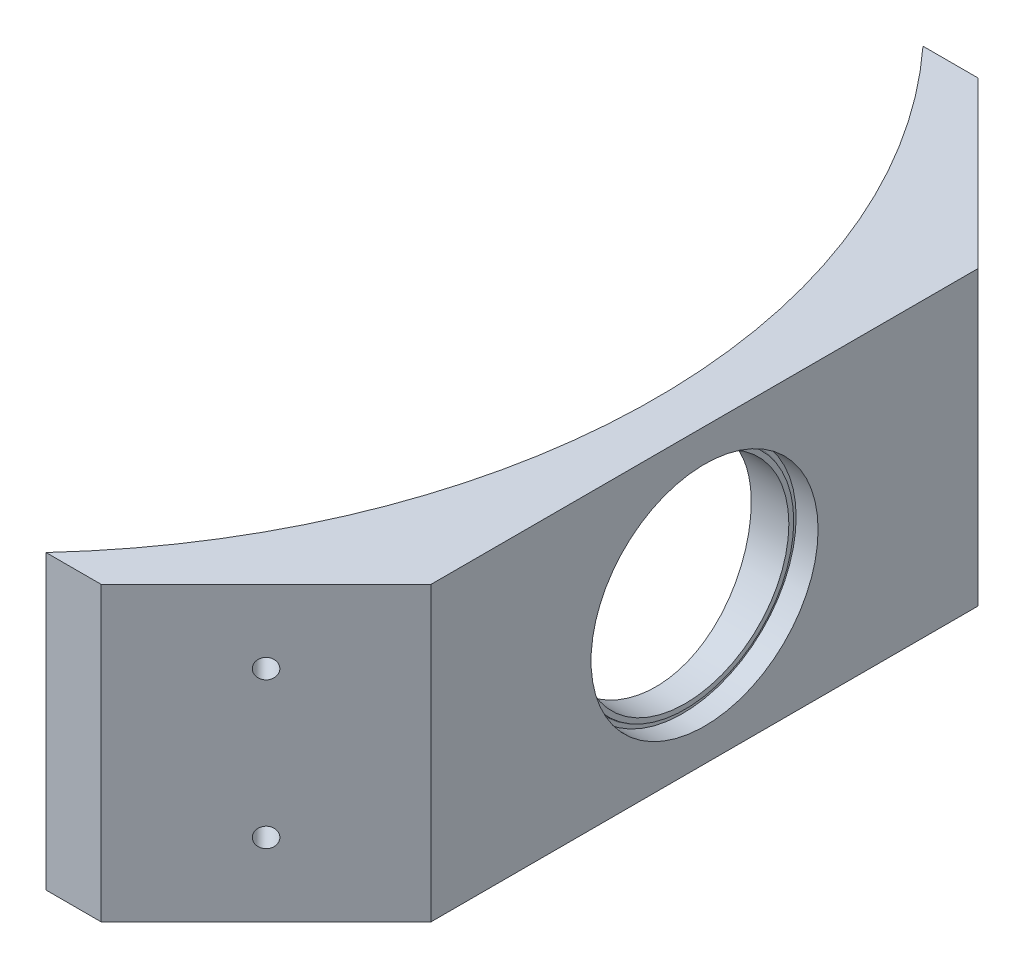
ISO-10303-21;
HEADER;
FILE_DESCRIPTION(('STEP AP214'),'2;1');
FILE_NAME('part.step','',(''),(''),'','','');
FILE_SCHEMA(('AUTOMOTIVE_DESIGN { 1 0 10303 214 1 1 1 1 }'));
ENDSEC;
DATA;
#1=APPLICATION_CONTEXT('core data for automotive mechanical design processes');
#2=APPLICATION_PROTOCOL_DEFINITION('international standard','automotive_design',2000,#1);
#3=PRODUCT_CONTEXT('',#1,'mechanical');
#4=PRODUCT('Part','Part','',(#3));
#5=PRODUCT_RELATED_PRODUCT_CATEGORY('part','',(#4));
#6=PRODUCT_DEFINITION_FORMATION('','',#4);
#7=PRODUCT_DEFINITION_CONTEXT('part definition',#1,'design');
#8=PRODUCT_DEFINITION('design','',#6,#7);
#9=PRODUCT_DEFINITION_SHAPE('','',#8);
#10=(LENGTH_UNIT() NAMED_UNIT(*) SI_UNIT(.MILLI.,.METRE.));
#11=(NAMED_UNIT(*) PLANE_ANGLE_UNIT() SI_UNIT($,.RADIAN.));
#12=(NAMED_UNIT(*) SI_UNIT($,.STERADIAN.) SOLID_ANGLE_UNIT());
#13=UNCERTAINTY_MEASURE_WITH_UNIT(LENGTH_MEASURE(1.E-05),#10,'distance_accuracy_value','');
#14=(GEOMETRIC_REPRESENTATION_CONTEXT(3) GLOBAL_UNCERTAINTY_ASSIGNED_CONTEXT((#13)) GLOBAL_UNIT_ASSIGNED_CONTEXT((#10,
#11,#12)) REPRESENTATION_CONTEXT('',''));
#15=CARTESIAN_POINT('',(0.,0.,0.));
#16=DIRECTION('',(0.,0.,1.));
#17=DIRECTION('',(1.,0.,0.));
#18=AXIS2_PLACEMENT_3D('',#15,#16,#17);
#19=CARTESIAN_POINT('',(-67.3699999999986,34.7500670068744,-4.81806655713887));
#20=DIRECTION('',(0.,1.,0.));
#21=DIRECTION('',(0.,0.,1.));
#22=AXIS2_PLACEMENT_3D('',#19,#20,#21);
#23=CYLINDRICAL_SURFACE('',#22,66.3699999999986);
#24=CARTESIAN_POINT('',(-9.5782322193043,57.2500670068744,-37.4537598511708));
#25=CARTESIAN_POINT('',(-9.57823080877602,57.3046931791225,-37.4537574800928));
#26=CARTESIAN_POINT('',(-9.5759381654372,57.3593606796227,-37.4496985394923));
#27=CARTESIAN_POINT('',(-9.56684343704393,57.4671640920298,-37.4335854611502));
#28=CARTESIAN_POINT('',(-9.56003576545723,57.520298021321,-37.4215214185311));
#29=CARTESIAN_POINT('',(-9.54216553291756,57.6234274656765,-37.3898148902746));
#30=CARTESIAN_POINT('',(-9.53110817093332,57.6734267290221,-37.3701816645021));
#31=CARTESIAN_POINT('',(-9.50512634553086,57.7689941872,-37.3239736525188));
#32=CARTESIAN_POINT('',(-9.49020262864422,57.814563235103,-37.2974002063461));
#33=CARTESIAN_POINT('',(-9.45672472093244,57.900788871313,-37.2376691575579));
#34=CARTESIAN_POINT('',(-9.43811861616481,57.9413599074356,-37.2044172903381));
#35=CARTESIAN_POINT('',(-9.39801634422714,58.0157927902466,-37.1325787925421));
#36=CARTESIAN_POINT('',(-9.3765196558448,58.049653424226,-37.093991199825));
#37=CARTESIAN_POINT('',(-9.33048232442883,58.1109673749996,-37.0111342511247));
#38=CARTESIAN_POINT('',(-9.30586172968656,58.1381563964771,-36.9667137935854));
#39=CARTESIAN_POINT('',(-9.25492880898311,58.1839658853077,-36.8745506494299));
#40=CARTESIAN_POINT('',(-9.22861616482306,58.2025847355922,-36.8268073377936));
#41=CARTESIAN_POINT('',(-9.17404529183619,58.231404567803,-36.7274864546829));
#42=CARTESIAN_POINT('',(-9.14575110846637,58.2412749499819,-36.6758325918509));
#43=CARTESIAN_POINT('',(-9.08890886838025,58.2512393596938,-36.5717251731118));
#44=CARTESIAN_POINT('',(-9.06036077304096,58.2513318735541,-36.5192714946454));
#45=CARTESIAN_POINT('',(-9.00311537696,58.2416462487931,-36.4137524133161));
#46=CARTESIAN_POINT('',(-8.97443024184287,58.2316368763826,-36.360701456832));
#47=CARTESIAN_POINT('',(-8.91840137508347,58.2016269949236,-36.2567530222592));
#48=CARTESIAN_POINT('',(-8.89105771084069,58.181625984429,-36.2058556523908));
#49=CARTESIAN_POINT('',(-8.83853402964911,58.1321232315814,-36.1078010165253));
#50=CARTESIAN_POINT('',(-8.81335082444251,58.1026358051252,-36.0606382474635));
#51=CARTESIAN_POINT('',(-8.76586140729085,58.0348509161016,-35.9714675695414));
#52=CARTESIAN_POINT('',(-8.74355481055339,57.9965546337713,-35.9294589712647));
#53=CARTESIAN_POINT('',(-8.70313423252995,57.9133677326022,-35.8531688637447));
#54=CARTESIAN_POINT('',(-8.68491755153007,57.8687001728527,-35.8186988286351));
#55=CARTESIAN_POINT('',(-8.65248481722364,57.7731964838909,-35.7572249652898));
#56=CARTESIAN_POINT('',(-8.6382676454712,57.7223620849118,-35.7302190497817));
#57=CARTESIAN_POINT('',(-8.61487470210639,57.6183897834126,-35.6857318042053));
#58=CARTESIAN_POINT('',(-8.60550352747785,57.565453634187,-35.6678815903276));
#59=CARTESIAN_POINT('',(-8.59121216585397,57.4568740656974,-35.6406433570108));
#60=CARTESIAN_POINT('',(-8.5862908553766,57.4012313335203,-35.6312532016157));
#61=CARTESIAN_POINT('',(-8.58117477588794,57.2910338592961,-35.6214910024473));
#62=CARTESIAN_POINT('',(-8.58081178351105,57.2365150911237,-35.6207979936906));
#63=CARTESIAN_POINT('',(-8.58439015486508,57.1281414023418,-35.6276265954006));
#64=CARTESIAN_POINT('',(-8.5883311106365,57.0742864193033,-35.6351474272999));
#65=CARTESIAN_POINT('',(-8.60031652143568,56.9693477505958,-35.6579979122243));
#66=CARTESIAN_POINT('',(-8.60831699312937,56.9182407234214,-35.6732438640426));
#67=CARTESIAN_POINT('',(-8.6281369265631,56.8195604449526,-35.7109601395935));
#68=CARTESIAN_POINT('',(-8.63995664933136,56.7719874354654,-35.7334309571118));
#69=CARTESIAN_POINT('',(-8.66732573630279,56.6806655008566,-35.7853688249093));
#70=CARTESIAN_POINT('',(-8.68294504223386,56.6370122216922,-35.8149669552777));
#71=CARTESIAN_POINT('',(-8.71732038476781,56.5556714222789,-35.8799632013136));
#72=CARTESIAN_POINT('',(-8.73607697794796,56.5179849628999,-35.9153623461));
#73=CARTESIAN_POINT('',(-8.7770207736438,56.4480311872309,-35.9924416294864));
#74=CARTESIAN_POINT('',(-8.79931529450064,56.4160413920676,-36.0343165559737));
#75=CARTESIAN_POINT('',(-8.84613466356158,56.360106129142,-36.12200490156));
#76=CARTESIAN_POINT('',(-8.87065998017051,56.3361623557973,-36.1678191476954));
#77=CARTESIAN_POINT('',(-8.92236671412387,56.2959898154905,-36.2641182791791));
#78=CARTESIAN_POINT('',(-8.94961622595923,56.280124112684,-36.3147182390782));
#79=CARTESIAN_POINT('',(-9.00511845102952,56.2579986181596,-36.41744805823));
#80=CARTESIAN_POINT('',(-9.03337133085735,56.2517404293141,-36.4695781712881));
#81=CARTESIAN_POINT('',(-9.09084416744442,56.2489456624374,-36.5752799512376));
#82=CARTESIAN_POINT('',(-9.1200705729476,56.2526576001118,-36.6288548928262));
#83=CARTESIAN_POINT('',(-9.17795548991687,56.2702851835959,-36.7346216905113));
#84=CARTESIAN_POINT('',(-9.20661397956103,56.2842012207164,-36.7868134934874));
#85=CARTESIAN_POINT('',(-9.2624627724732,56.321923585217,-36.8882141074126));
#86=CARTESIAN_POINT('',(-9.28965544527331,56.345713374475,-36.9374277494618));
#87=CARTESIAN_POINT('',(-9.34175885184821,56.402641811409,-37.0314647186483));
#88=CARTESIAN_POINT('',(-9.36666995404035,56.435778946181,-37.0762887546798));
#89=CARTESIAN_POINT('',(-9.41273808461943,56.5095677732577,-37.1589830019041));
#90=CARTESIAN_POINT('',(-9.43397729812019,56.5499963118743,-37.1970063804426));
#91=CARTESIAN_POINT('',(-9.4727444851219,56.6378617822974,-37.2662758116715));
#92=CARTESIAN_POINT('',(-9.49027231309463,56.6852989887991,-37.2975215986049));
#93=CARTESIAN_POINT('',(-9.52036891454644,56.7838937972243,-37.3510958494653));
#94=CARTESIAN_POINT('',(-9.53309976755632,56.8348436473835,-37.3737161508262));
#95=CARTESIAN_POINT('',(-9.55401874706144,56.9404387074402,-37.4108521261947));
#96=CARTESIAN_POINT('',(-9.56221376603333,56.9950781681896,-37.4253800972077));
#97=CARTESIAN_POINT('',(-9.57138999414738,57.0834650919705,-37.4416412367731));
#98=CARTESIAN_POINT('',(-9.57395185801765,57.1165648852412,-37.4461791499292));
#99=CARTESIAN_POINT('',(-9.57737338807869,57.1831269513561,-37.4522391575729));
#100=CARTESIAN_POINT('',(-9.57823308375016,57.2165892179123,-37.453761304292));
#101=CARTESIAN_POINT('',(-9.5782322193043,57.2500670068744,-37.4537598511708));
#102=B_SPLINE_CURVE_WITH_KNOTS('',3,(#24,#25,#26,#27,#28,#29,#30,#31,#32,#33,#34,#35,#36,#37,
#38,#39,#40,#41,#42,#43,#44,#45,#46,#47,#48,#49,#50,#51,#52,#53,#54,#55,#56,#57,#58,#59,#60,#61,
#62,#63,#64,#65,#66,#67,#68,#69,#70,#71,#72,#73,#74,#75,#76,#77,#78,#79,#80,#81,#82,#83,#84,#85,
#86,#87,#88,#89,#90,#91,#92,#93,#94,#95,#96,#97,#98,#99,#100,#101),.UNSPECIFIED.,.T.,.F.,(4,2,2,
2,2,2,2,2,2,2,2,2,2,2,2,2,2,2,2,2,2,2,2,2,2,2,2,2,2,2,2,2,2,2,2,2,2,2,4),(0.,0.163753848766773,
0.327710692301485,0.491467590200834,0.655192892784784,0.821416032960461,0.987669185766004,
1.15971390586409,1.33179107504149,1.51012340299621,1.68848333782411,1.87102068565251,
2.05356719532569,2.23583950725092,2.41808741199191,2.59505806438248,2.77197917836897,
2.94106408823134,3.1101062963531,3.27289089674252,3.43566006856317,3.59670219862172,
3.75775533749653,3.922033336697,4.08634051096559,4.25722887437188,4.42815320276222,
4.6062000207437,4.78427653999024,4.96683272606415,5.14939591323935,5.33165454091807,
5.51388368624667,5.69126907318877,5.86866141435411,6.03936434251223,6.2098071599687,
6.31016586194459,6.41052282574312),.UNSPECIFIED.);
#103=CARTESIAN_POINT('',(-9.5782322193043,57.2500670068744,-37.4537598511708));
#104=VERTEX_POINT('',#103);
#105=EDGE_CURVE('E179',#104,#104,#102,.T.);
#106=ORIENTED_EDGE('',*,*,#105,.T.);
#107=EDGE_LOOP('',(#106));
#108=FACE_BOUND('',#107,.T.);
#109=CARTESIAN_POINT('',(-8.65047059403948,57.2500670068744,26.1172492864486));
#110=CARTESIAN_POINT('',(-8.65047187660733,57.3044044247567,26.1172518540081));
#111=CARTESIAN_POINT('',(-8.65264034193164,57.3587832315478,26.1213688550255));
#112=CARTESIAN_POINT('',(-8.66124722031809,57.4660081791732,26.1376975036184));
#113=CARTESIAN_POINT('',(-8.66769095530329,57.5188523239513,26.1499192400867));
#114=CARTESIAN_POINT('',(-8.68462134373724,57.6214009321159,26.1819908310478));
#115=CARTESIAN_POINT('',(-8.69510208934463,57.6711098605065,26.2018295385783));
#116=CARTESIAN_POINT('',(-8.71976854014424,57.7661404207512,26.248441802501));
#117=CARTESIAN_POINT('',(-8.73395363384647,57.811462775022,26.2752142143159));
#118=CARTESIAN_POINT('',(-8.76592114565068,57.8974727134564,26.3354247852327));
#119=CARTESIAN_POINT('',(-8.78376935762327,57.9380504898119,26.3689846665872));
#120=CARTESIAN_POINT('',(-8.82236866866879,58.0125663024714,26.441387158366));
#121=CARTESIAN_POINT('',(-8.84312038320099,58.0465029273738,26.4802308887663));
#122=CARTESIAN_POINT('',(-8.88790028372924,58.1082854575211,26.5638271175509));
#123=CARTESIAN_POINT('',(-8.91202968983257,58.1358144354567,26.6087596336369));
#124=CARTESIAN_POINT('',(-8.96219048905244,58.1822798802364,26.701887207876));
#125=CARTESIAN_POINT('',(-8.98822227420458,58.2012145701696,26.7500829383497));
#126=CARTESIAN_POINT('',(-9.04252446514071,58.230643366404,26.8503066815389));
#127=CARTESIAN_POINT('',(-9.0708422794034,58.2407919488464,26.9024106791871));
#128=CARTESIAN_POINT('',(-9.12803492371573,58.2511795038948,27.0073002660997));
#129=CARTESIAN_POINT('',(-9.15690982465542,58.2514172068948,27.0600859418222));
#130=CARTESIAN_POINT('',(-9.2149233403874,58.2418695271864,27.1657989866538));
#131=CARTESIAN_POINT('',(-9.24405792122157,58.2319112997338,27.218713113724));
#132=CARTESIAN_POINT('',(-9.30123072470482,58.2018972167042,27.3222264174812));
#133=CARTESIAN_POINT('',(-9.32926895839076,58.1818414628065,27.3728256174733));
#134=CARTESIAN_POINT('',(-9.38310901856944,58.1323228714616,27.4697084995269));
#135=CARTESIAN_POINT('',(-9.4089302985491,58.1029554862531,27.5160300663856));
#136=CARTESIAN_POINT('',(-9.45779664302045,58.0354617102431,27.6034712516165));
#137=CARTESIAN_POINT('',(-9.48084215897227,57.9973367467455,27.6445917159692));
#138=CARTESIAN_POINT('',(-9.52267631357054,57.914659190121,27.7190785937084));
#139=CARTESIAN_POINT('',(-9.54157557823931,57.8703450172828,27.7526473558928));
#140=CARTESIAN_POINT('',(-9.5753249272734,57.7756631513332,27.8124960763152));
#141=CARTESIAN_POINT('',(-9.5901759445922,57.7252968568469,27.838777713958));
#142=CARTESIAN_POINT('',(-9.61478827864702,57.6219920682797,27.8822854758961));
#143=CARTESIAN_POINT('',(-9.62472051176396,57.569222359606,27.8998158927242));
#144=CARTESIAN_POINT('',(-9.63994074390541,57.4609934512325,27.926664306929));
#145=CARTESIAN_POINT('',(-9.64522960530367,57.4055347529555,27.9359838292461));
#146=CARTESIAN_POINT('',(-9.6508808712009,57.2951716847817,27.9459414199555));
#147=CARTESIAN_POINT('',(-9.65137709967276,57.240295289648,27.9468153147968));
#148=CARTESIAN_POINT('',(-9.64777428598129,57.1311682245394,27.940467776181));
#149=CARTESIAN_POINT('',(-9.643675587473,57.0769175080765,27.9332469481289));
#150=CARTESIAN_POINT('',(-9.63108346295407,56.9710136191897,27.9110424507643));
#151=CARTESIAN_POINT('',(-9.62262475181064,56.9193434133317,27.8961201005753));
#152=CARTESIAN_POINT('',(-9.60162993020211,56.8195577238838,27.8590320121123));
#153=CARTESIAN_POINT('',(-9.58909364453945,56.771442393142,27.8368659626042));
#154=CARTESIAN_POINT('',(-9.56015782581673,56.6793598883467,27.785613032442));
#155=CARTESIAN_POINT('',(-9.54370546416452,56.6354621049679,27.7564314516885));
#156=CARTESIAN_POINT('',(-9.50757396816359,56.553701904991,27.6922073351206));
#157=CARTESIAN_POINT('',(-9.48789440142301,56.5158402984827,27.6571640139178));
#158=CARTESIAN_POINT('',(-9.44525419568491,56.4459555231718,27.581048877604));
#159=CARTESIAN_POINT('',(-9.42221067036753,56.4141500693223,27.5398236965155));
#160=CARTESIAN_POINT('',(-9.37402165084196,56.3585912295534,27.4533735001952));
#161=CARTESIAN_POINT('',(-9.3488757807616,56.3348392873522,27.4081477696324));
#162=CARTESIAN_POINT('',(-9.29623294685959,56.2951549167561,27.3131881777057));
#163=CARTESIAN_POINT('',(-9.26868352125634,56.2795423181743,27.2633496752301));
#164=CARTESIAN_POINT('',(-9.21285736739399,56.2578021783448,27.1620367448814));
#165=CARTESIAN_POINT('',(-9.18458051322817,56.2516762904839,27.1105620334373));
#166=CARTESIAN_POINT('',(-9.12725243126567,56.2489755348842,27.0058696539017));
#167=CARTESIAN_POINT('',(-9.09820212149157,56.2526780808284,26.9526441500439));
#168=CARTESIAN_POINT('',(-9.04094192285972,56.270128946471,26.8473953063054));
#169=CARTESIAN_POINT('',(-9.0127321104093,56.2838781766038,26.7953720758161));
#170=CARTESIAN_POINT('',(-8.95774504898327,56.3212449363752,26.6936572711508));
#171=CARTESIAN_POINT('',(-8.93097928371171,56.344931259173,26.6439846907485));
#172=CARTESIAN_POINT('',(-8.87988043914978,56.4016307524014,26.5488862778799));
#173=CARTESIAN_POINT('',(-8.8555470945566,56.4346429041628,26.5034599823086));
#174=CARTESIAN_POINT('',(-8.81053873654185,56.5084022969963,26.4192289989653));
#175=CARTESIAN_POINT('',(-8.78979826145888,56.548974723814,26.3803064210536));
#176=CARTESIAN_POINT('',(-8.75203667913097,56.6372418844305,26.3092991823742));
#177=CARTESIAN_POINT('',(-8.73501565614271,56.6849367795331,26.2772146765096));
#178=CARTESIAN_POINT('',(-8.70589664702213,56.784015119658,26.2222428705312));
#179=CARTESIAN_POINT('',(-8.69362718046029,56.8351709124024,26.1990356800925));
#180=CARTESIAN_POINT('',(-8.67350586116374,56.941252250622,26.1609415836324));
#181=CARTESIAN_POINT('',(-8.66564693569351,56.996171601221,26.1460413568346));
#182=CARTESIAN_POINT('',(-8.6569223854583,57.0846273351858,26.1294932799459));
#183=CARTESIAN_POINT('',(-8.65450652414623,57.117495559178,26.1249090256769));
#184=CARTESIAN_POINT('',(-8.65128025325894,57.1835930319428,26.1187862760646));
#185=CARTESIAN_POINT('',(-8.65046980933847,57.2168222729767,26.1172477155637));
#186=CARTESIAN_POINT('',(-8.65047059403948,57.2500670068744,26.1172492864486));
#187=B_SPLINE_CURVE_WITH_KNOTS('',3,(#109,#110,#111,#112,#113,#114,#115,#116,#117,#118,#119,
#120,#121,#122,#123,#124,#125,#126,#127,#128,#129,#130,#131,#132,#133,#134,#135,#136,#137,#138,
#139,#140,#141,#142,#143,#144,#145,#146,#147,#148,#149,#150,#151,#152,#153,#154,#155,#156,#157,
#158,#159,#160,#161,#162,#163,#164,#165,#166,#167,#168,#169,#170,#171,#172,#173,#174,#175,#176,
#177,#178,#179,#180,#181,#182,#183,#184,#185,#186),.UNSPECIFIED.,.T.,.F.,(4,2,2,2,2,2,2,2,2,2,2,
2,2,2,2,2,2,2,2,2,2,2,2,2,2,2,2,2,2,2,2,2,2,2,2,2,2,2,4),(0.,0.162887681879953,
0.325978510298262,0.488831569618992,0.651657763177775,0.817714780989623,0.983807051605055,
1.15689845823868,1.33002563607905,1.50968676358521,1.6893709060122,1.8721523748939,
2.05493200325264,2.23589546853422,2.41682946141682,2.59210258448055,2.7673352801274,
2.93595542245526,3.10454424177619,3.26841149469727,3.43226649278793,3.59483656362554,
3.75741362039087,3.92232238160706,4.08725325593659,4.25730380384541,4.42738481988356,
4.60372314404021,4.78009219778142,4.96149193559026,5.14290811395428,5.32560149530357,
5.5082749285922,5.68715593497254,5.86604099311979,6.03768039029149,6.20904375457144,
6.30870387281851,6.40836185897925),.UNSPECIFIED.);
#188=CARTESIAN_POINT('',(-8.65047059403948,57.2500670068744,26.1172492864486));
#189=VERTEX_POINT('',#188);
#190=EDGE_CURVE('E168',#189,#189,#187,.T.);
#191=ORIENTED_EDGE('',*,*,#190,.T.);
#192=EDGE_LOOP('',(#191));
#193=FACE_BOUND('',#192,.T.);
#194=CARTESIAN_POINT('',(-1.86004350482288,49.7500670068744,-15.4680665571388));
#195=CARTESIAN_POINT('',(-1.86004543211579,49.4529302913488,-15.4680709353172));
#196=CARTESIAN_POINT('',(-1.85801794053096,49.1558535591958,-15.4556273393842));
#197=CARTESIAN_POINT('',(-1.84997101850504,48.5637419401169,-15.4059547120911));
#198=CARTESIAN_POINT('',(-1.84395077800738,48.2687074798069,-15.3687206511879));
#199=CARTESIAN_POINT('',(-1.82808438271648,47.6826510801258,-15.269702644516));
#200=CARTESIAN_POINT('',(-1.81823507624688,47.3916326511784,-15.20789847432));
#201=CARTESIAN_POINT('',(-1.79499747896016,46.8159083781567,-15.060211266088));
#202=CARTESIAN_POINT('',(-1.78160910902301,46.5312026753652,-14.9743276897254));
#203=CARTESIAN_POINT('',(-1.75169239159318,45.9703506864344,-14.7792075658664));
#204=CARTESIAN_POINT('',(-1.73516668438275,45.6941974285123,-14.6699906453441));
#205=CARTESIAN_POINT('',(-1.69944015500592,45.1521123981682,-14.4289615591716));
#206=CARTESIAN_POINT('',(-1.68023930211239,44.8861807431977,-14.2971491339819));
#207=CARTESIAN_POINT('',(-1.63970936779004,44.3664027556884,-14.0118977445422));
#208=CARTESIAN_POINT('',(-1.61838059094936,44.112554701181,-13.8584618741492));
#209=CARTESIAN_POINT('',(-1.57419114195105,43.6186250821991,-13.5310291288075));
#210=CARTESIAN_POINT('',(-1.55133045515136,43.3785436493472,-13.357032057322));
#211=CARTESIAN_POINT('',(-1.50452322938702,42.9118668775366,-12.9881767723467));
#212=CARTESIAN_POINT('',(-1.48056933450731,42.685398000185,-12.7931594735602));
#213=CARTESIAN_POINT('',(-1.43242601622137,42.2496560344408,-12.384802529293));
#214=CARTESIAN_POINT('',(-1.40823659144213,42.0403830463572,-12.1714627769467));
#215=CARTESIAN_POINT('',(-1.36029870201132,41.6404622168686,-11.7279134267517));
#216=CARTESIAN_POINT('',(-1.33655026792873,41.4498156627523,-11.4977026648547));
#217=CARTESIAN_POINT('',(-1.29016125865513,41.0884967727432,-11.0220094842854));
#218=CARTESIAN_POINT('',(-1.26752065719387,40.9178239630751,-10.7765274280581));
#219=CARTESIAN_POINT('',(-1.2238595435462,40.5967647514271,-10.2705724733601));
#220=CARTESIAN_POINT('',(-1.2028487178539,40.4464961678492,-10.0100239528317));
#221=CARTESIAN_POINT('',(-1.1631833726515,40.1684642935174,-9.47700860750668));
#222=CARTESIAN_POINT('',(-1.14452886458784,40.0407011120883,-9.20454172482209));
#223=CARTESIAN_POINT('',(-1.11010802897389,39.8086355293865,-8.64963024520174));
#224=CARTESIAN_POINT('',(-1.09434156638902,39.7043320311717,-8.36718611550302));
#225=CARTESIAN_POINT('',(-1.06614656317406,39.5199698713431,-7.79433068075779));
#226=CARTESIAN_POINT('',(-1.05371799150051,39.4399109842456,-7.50391944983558));
#227=CARTESIAN_POINT('',(-1.0326460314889,39.3052347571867,-6.91974627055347));
#228=CARTESIAN_POINT('',(-1.02397112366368,39.2504053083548,-6.62603435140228));
#229=CARTESIAN_POINT('',(-1.01049830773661,39.1656056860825,-6.03495520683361));
#230=CARTESIAN_POINT('',(-1.00570037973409,39.1356353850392,-5.73758800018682));
#231=CARTESIAN_POINT('',(-1.00011790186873,39.1007878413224,-5.14136591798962));
#232=CARTESIAN_POINT('',(-0.999333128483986,39.0959092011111,-4.84251112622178));
#233=CARTESIAN_POINT('',(-1.00179869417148,39.1112793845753,-4.24546599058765));
#234=CARTESIAN_POINT('',(-1.00504901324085,39.1315280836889,-3.9472756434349));
#235=CARTESIAN_POINT('',(-1.01544416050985,39.1966931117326,-3.35645203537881));
#236=CARTESIAN_POINT('',(-1.02255288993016,39.2413808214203,-3.06379288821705));
#237=CARTESIAN_POINT('',(-1.04044267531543,39.3549280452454,-2.48331904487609));
#238=CARTESIAN_POINT('',(-1.05122370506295,39.4237873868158,-2.19550431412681));
#239=CARTESIAN_POINT('',(-1.0761592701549,39.5851633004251,-1.62673115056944));
#240=CARTESIAN_POINT('',(-1.09031387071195,39.67768032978,-1.34577285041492));
#241=CARTESIAN_POINT('',(-1.12160541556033,39.8856892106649,-0.792665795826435));
#242=CARTESIAN_POINT('',(-1.13874237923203,40.0011812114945,-0.520517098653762));
#243=CARTESIAN_POINT('',(-1.17560573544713,40.2548451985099,0.0142429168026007));
#244=CARTESIAN_POINT('',(-1.19534286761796,40.3931118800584,0.276808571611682));
#245=CARTESIAN_POINT('',(-1.23680396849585,40.6909854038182,0.789375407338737));
#246=CARTESIAN_POINT('',(-1.25852794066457,40.8505922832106,1.03937656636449));
#247=CARTESIAN_POINT('',(-1.30336539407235,41.1900376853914,1.52513450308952));
#248=CARTESIAN_POINT('',(-1.32647896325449,41.3698774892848,1.76089037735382));
#249=CARTESIAN_POINT('',(-1.3734580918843,41.7485404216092,2.2165497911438));
#250=CARTESIAN_POINT('',(-1.39732365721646,41.9473636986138,2.43645320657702));
#251=CARTESIAN_POINT('',(-1.44541863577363,42.3649793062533,2.86130183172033));
#252=CARTESIAN_POINT('',(-1.46964911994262,42.5839712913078,3.06605071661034));
#253=CARTESIAN_POINT('',(-1.5175218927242,43.0384703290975,3.45639450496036));
#254=CARTESIAN_POINT('',(-1.54116417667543,43.2739775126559,3.64198925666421));
#255=CARTESIAN_POINT('',(-1.58718911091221,43.7598839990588,3.99272155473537));
#256=CARTESIAN_POINT('',(-1.60957174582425,44.0102834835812,4.15785885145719));
#257=CARTESIAN_POINT('',(-1.65243664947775,44.5242371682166,4.46649333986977));
#258=CARTESIAN_POINT('',(-1.67291892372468,44.7877913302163,4.60999059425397));
#259=CARTESIAN_POINT('',(-1.71141146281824,45.3264841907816,4.87443225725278));
#260=CARTESIAN_POINT('',(-1.72941924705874,45.6016341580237,4.9953540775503));
#261=CARTESIAN_POINT('',(-1.7624134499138,46.1613285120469,5.21356709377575));
#262=CARTESIAN_POINT('',(-1.77739986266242,46.445872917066,5.3108582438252));
#263=CARTESIAN_POINT('',(-1.80390940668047,47.0223000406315,5.48106400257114));
#264=CARTESIAN_POINT('',(-1.81543276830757,47.3141822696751,5.55398023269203));
#265=CARTESIAN_POINT('',(-1.83467570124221,47.9031884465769,5.67487978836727));
#266=CARTESIAN_POINT('',(-1.84239531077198,48.2003123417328,5.72286336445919));
#267=CARTESIAN_POINT('',(-1.85373746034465,48.7943178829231,5.79313017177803));
#268=CARTESIAN_POINT('',(-1.85740446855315,49.0911657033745,5.81569239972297));
#269=CARTESIAN_POINT('',(-1.8606863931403,49.6857295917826,5.83589220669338));
#270=CARTESIAN_POINT('',(-1.86030133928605,49.9834456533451,5.83352996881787));
#271=CARTESIAN_POINT('',(-1.8554905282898,50.5775920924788,5.80389992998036));
#272=CARTESIAN_POINT('',(-1.8510649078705,50.8740225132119,5.77663297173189));
#273=CARTESIAN_POINT('',(-1.83830269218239,51.4634786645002,5.69740557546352));
#274=CARTESIAN_POINT('',(-1.82996610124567,51.7565043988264,5.64544516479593));
#275=CARTESIAN_POINT('',(-1.80968437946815,52.3353664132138,5.51760334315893));
#276=CARTESIAN_POINT('',(-1.79776056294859,52.6212346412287,5.44186311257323));
#277=CARTESIAN_POINT('',(-1.77062918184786,53.1855416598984,5.26693589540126));
#278=CARTESIAN_POINT('',(-1.75542163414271,53.4639804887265,5.16774902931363));
#279=CARTESIAN_POINT('',(-1.72215414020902,54.011516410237,4.94665169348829));
#280=CARTESIAN_POINT('',(-1.70409410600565,54.2806132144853,4.8247405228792));
#281=CARTESIAN_POINT('',(-1.66562989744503,54.8076288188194,4.55906812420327));
#282=CARTESIAN_POINT('',(-1.64522564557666,55.0655472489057,4.41530617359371));
#283=CARTESIAN_POINT('',(-1.60246037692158,55.5706111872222,4.10562452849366));
#284=CARTESIAN_POINT('',(-1.58008410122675,55.8176455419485,3.93952564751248));
#285=CARTESIAN_POINT('',(-1.53415671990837,56.2968802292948,3.58729904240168));
#286=CARTESIAN_POINT('',(-1.5106056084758,56.529080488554,3.40117121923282));
#287=CARTESIAN_POINT('',(-1.46298561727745,56.9770836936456,3.01016023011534));
#288=CARTESIAN_POINT('',(-1.43891670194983,57.1928855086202,2.80527577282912));
#289=CARTESIAN_POINT('',(-1.39093312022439,57.606598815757,2.37816870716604));
#290=CARTESIAN_POINT('',(-1.36701845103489,57.8045106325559,2.15594641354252));
#291=CARTESIAN_POINT('',(-1.31978016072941,58.1829033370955,1.69345375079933));
#292=CARTESIAN_POINT('',(-1.29646444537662,58.3631980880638,1.45303023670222));
#293=CARTESIAN_POINT('',(-1.25132556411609,58.7028911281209,0.957712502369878));
#294=CARTESIAN_POINT('',(-1.22950240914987,58.8622892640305,0.70281817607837));
#295=CARTESIAN_POINT('',(-1.18796714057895,59.1590343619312,0.180342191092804));
#296=CARTESIAN_POINT('',(-1.1682549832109,59.2963817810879,-0.0872392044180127));
#297=CARTESIAN_POINT('',(-1.13150117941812,59.548017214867,-0.633210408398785));
#298=CARTESIAN_POINT('',(-1.11445951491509,59.662305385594,-0.911600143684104));
#299=CARTESIAN_POINT('',(-1.08359639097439,59.8665416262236,-1.47603952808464));
#300=CARTESIAN_POINT('',(-1.0697619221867,59.9565882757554,-1.76205279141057));
#301=CARTESIAN_POINT('',(-1.04561617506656,60.1122777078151,-2.34079331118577));
#302=CARTESIAN_POINT('',(-1.03530489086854,60.1779205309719,-2.63352055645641));
#303=CARTESIAN_POINT('',(-1.0185001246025,60.284292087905,-3.2235570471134));
#304=CARTESIAN_POINT('',(-1.01200639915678,60.3250224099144,-3.52086599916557));
#305=CARTESIAN_POINT('',(-1.00302156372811,60.3812569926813,-4.11791943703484));
#306=CARTESIAN_POINT('',(-1.0005304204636,60.3967614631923,-4.41766390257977));
#307=CARTESIAN_POINT('',(-0.999626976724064,60.4023916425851,-5.01402602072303));
#308=CARTESIAN_POINT('',(-1.00116916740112,60.3928005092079,-5.31064096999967));
#309=CARTESIAN_POINT('',(-1.00819284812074,60.3489120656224,-5.90198833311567));
#310=CARTESIAN_POINT('',(-1.0136743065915,60.3146149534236,-6.19672076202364));
#311=CARTESIAN_POINT('',(-1.02842307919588,60.2215775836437,-6.78220187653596));
#312=CARTESIAN_POINT('',(-1.03769036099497,60.1628375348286,-7.07295059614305));
#313=CARTESIAN_POINT('',(-1.0597522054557,60.0213590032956,-7.64841186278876));
#314=CARTESIAN_POINT('',(-1.0725467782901,59.9386204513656,-7.93312439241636));
#315=CARTESIAN_POINT('',(-1.10129356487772,59.7498539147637,-8.49424674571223));
#316=CARTESIAN_POINT('',(-1.11724270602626,59.643848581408,-8.77066434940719));
#317=CARTESIAN_POINT('',(-1.15186578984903,59.4092774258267,-9.31357530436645));
#318=CARTESIAN_POINT('',(-1.17053972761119,59.2807116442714,-9.58006867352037));
#319=CARTESIAN_POINT('',(-1.21009489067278,59.0019675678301,-10.101262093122));
#320=CARTESIAN_POINT('',(-1.23097569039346,58.8517934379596,-10.3559644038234));
#321=CARTESIAN_POINT('',(-1.2743849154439,58.5307972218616,-10.8520200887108));
#322=CARTESIAN_POINT('',(-1.29691407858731,58.3599658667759,-11.093367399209));
#323=CARTESIAN_POINT('',(-1.34324066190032,57.9969626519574,-11.5634603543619));
#324=CARTESIAN_POINT('',(-1.36704903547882,57.8045828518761,-11.7920443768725));
#325=CARTESIAN_POINT('',(-1.41503447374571,57.4014139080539,-12.2321350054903));
#326=CARTESIAN_POINT('',(-1.43921138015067,57.1906324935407,-12.443648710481));
#327=CARTESIAN_POINT('',(-1.48727769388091,56.7519411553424,-12.8483439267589));
#328=CARTESIAN_POINT('',(-1.5111669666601,56.5240235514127,-13.0415171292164));
#329=CARTESIAN_POINT('',(-1.55797433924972,56.0527089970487,-13.4080799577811));
#330=CARTESIAN_POINT('',(-1.58089244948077,55.8093122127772,-13.5814697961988));
#331=CARTESIAN_POINT('',(-1.62525347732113,55.3070677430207,-13.9083137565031));
#332=CARTESIAN_POINT('',(-1.64668577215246,55.0481294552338,-14.061630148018));
#333=CARTESIAN_POINT('',(-1.68728921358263,54.5180767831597,-14.3458691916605));
#334=CARTESIAN_POINT('',(-1.70646039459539,54.2469625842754,-14.4767921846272));
#335=CARTESIAN_POINT('',(-1.74196686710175,53.6947040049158,-14.715171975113));
#336=CARTESIAN_POINT('',(-1.75830466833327,53.4135687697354,-14.822649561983));
#337=CARTESIAN_POINT('',(-1.78768242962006,52.8431487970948,-15.0134483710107));
#338=CARTESIAN_POINT('',(-1.80072311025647,52.5538658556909,-15.0967748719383));
#339=CARTESIAN_POINT('',(-1.82764101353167,51.8510786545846,-15.267298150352));
#340=CARTESIAN_POINT('',(-1.83973393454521,51.4345348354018,-15.3424987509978));
#341=CARTESIAN_POINT('',(-1.8559337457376,50.595309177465,-15.4428794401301));
#342=CARTESIAN_POINT('',(-1.86004076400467,50.1726274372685,-15.4680603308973));
#343=CARTESIAN_POINT('',(-1.86004350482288,49.7500670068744,-15.4680665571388));
#344=B_SPLINE_CURVE_WITH_KNOTS('',3,(#194,#195,#196,#197,#198,#199,#200,#201,#202,#203,#204,
#205,#206,#207,#208,#209,#210,#211,#212,#213,#214,#215,#216,#217,#218,#219,#220,#221,#222,#223,
#224,#225,#226,#227,#228,#229,#230,#231,#232,#233,#234,#235,#236,#237,#238,#239,#240,#241,#242,
#243,#244,#245,#246,#247,#248,#249,#250,#251,#252,#253,#254,#255,#256,#257,#258,#259,#260,#261,
#262,#263,#264,#265,#266,#267,#268,#269,#270,#271,#272,#273,#274,#275,#276,#277,#278,#279,#280,
#281,#282,#283,#284,#285,#286,#287,#288,#289,#290,#291,#292,#293,#294,#295,#296,#297,#298,#299,
#300,#301,#302,#303,#304,#305,#306,#307,#308,#309,#310,#311,#312,#313,#314,#315,#316,#317,#318,
#319,#320,#321,#322,#323,#324,#325,#326,#327,#328,#329,#330,#331,#332,#333,#334,#335,#336,#337,
#338,#339,#340,#341,#342,#343),.UNSPECIFIED.,.T.,.F.,(4,2,2,2,2,2,2,2,2,2,2,2,2,2,2,2,2,2,2,2,2,
2,2,2,2,2,2,2,2,2,2,2,2,2,2,2,2,2,2,2,2,2,2,2,2,2,2,2,2,2,2,2,2,2,2,2,2,2,2,2,2,2,2,2,2,2,2,2,2,
2,2,2,2,2,4),(0.,0.891039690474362,1.78226021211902,2.6742158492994,3.56619142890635,
4.45741965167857,5.34865811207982,6.23976918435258,7.1308887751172,8.02930186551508,
8.92772019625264,9.82620057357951,10.7246596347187,11.6281039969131,12.5315527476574,
13.434959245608,14.3383573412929,15.2340150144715,16.1296680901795,17.025271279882,
17.9208700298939,18.8082305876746,19.6955848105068,20.5829561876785,21.4703333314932,
22.3614978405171,23.2526639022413,24.1438864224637,25.0351159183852,25.936381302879,
26.8376538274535,27.7389373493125,28.6402182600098,29.5423961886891,30.444575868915,
31.3466955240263,32.2488061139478,33.1409166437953,34.0330206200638,34.9250944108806,
35.817167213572,36.704040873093,37.5909099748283,38.477806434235,39.3647322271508,
40.25925236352,41.1537769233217,42.0483631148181,42.9429330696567,43.8461144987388,
44.749302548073,45.6524718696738,46.555635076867,47.4550680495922,48.3544995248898,
49.2538736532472,50.153240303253,51.0425031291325,51.9317588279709,52.8210069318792,
53.7102576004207,54.5986463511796,55.4870335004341,56.3752496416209,57.263865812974,
58.1619477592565,59.0596542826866,59.9577655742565,60.8558672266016,61.7598398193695,
62.6637986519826,63.5669526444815,64.4699090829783,65.7370838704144,67.0042383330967),.UNSPECIFIED.);
#345=CARTESIAN_POINT('',(-1.86004350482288,49.7500670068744,-15.4680665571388));
#346=VERTEX_POINT('',#345);
#347=EDGE_CURVE('E42',#346,#346,#344,.T.);
#348=ORIENTED_EDGE('',*,*,#347,.F.);
#349=EDGE_LOOP('',(#348));
#350=FACE_BOUND('',#349,.T.);
#351=CARTESIAN_POINT('',(-67.3699999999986,64.7500670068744,-4.81806655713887));
#352=DIRECTION('',(0.,-1.,0.));
#353=DIRECTION('',(0.,0.,1.));
#354=AXIS2_PLACEMENT_3D('',#351,#352,#353);
#355=CIRCLE('',#354,66.3699999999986);
#356=CARTESIAN_POINT('',(-18.5849930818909,64.7500670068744,-49.8180665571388));
#357=VERTEX_POINT('',#356);
#358=CARTESIAN_POINT('',(-18.5849930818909,64.7500670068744,40.1819334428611));
#359=VERTEX_POINT('',#358);
#360=EDGE_CURVE('E393',#357,#359,#355,.T.);
#361=ORIENTED_EDGE('',*,*,#360,.F.);
#362=DIRECTION('',(0.,1.,0.));
#363=VECTOR('',#362,1.);
#364=CARTESIAN_POINT('',(-18.5849930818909,34.7500670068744,-49.8180665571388));
#365=LINE('',#364,#363);
#366=CARTESIAN_POINT('',(-18.5849930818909,34.7500670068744,-49.8180665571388));
#367=VERTEX_POINT('',#366);
#368=EDGE_CURVE('E387',#367,#357,#365,.T.);
#369=ORIENTED_EDGE('',*,*,#368,.F.);
#370=CARTESIAN_POINT('',(-67.3699999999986,34.7500670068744,-4.81806655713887));
#371=DIRECTION('',(0.,-1.,0.));
#372=DIRECTION('',(0.,0.,1.));
#373=AXIS2_PLACEMENT_3D('',#370,#371,#372);
#374=CIRCLE('',#373,66.3699999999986);
#375=CARTESIAN_POINT('',(-18.5849930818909,34.7500670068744,40.1819334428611));
#376=VERTEX_POINT('',#375);
#377=EDGE_CURVE('E390',#367,#376,#374,.T.);
#378=ORIENTED_EDGE('',*,*,#377,.T.);
#379=DIRECTION('',(0.,1.,0.));
#380=VECTOR('',#379,1.);
#381=CARTESIAN_POINT('',(-18.5849930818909,34.7500670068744,40.1819334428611));
#382=LINE('',#381,#380);
#383=EDGE_CURVE('E384',#376,#359,#382,.T.);
#384=ORIENTED_EDGE('',*,*,#383,.T.);
#385=EDGE_LOOP('',(#361,#369,#378,#384));
#386=FACE_BOUND('',#385,.T.);
#387=CARTESIAN_POINT('',(-8.65047059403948,42.2500670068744,26.1172492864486));
#388=CARTESIAN_POINT('',(-8.65047187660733,42.3044044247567,26.1172518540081));
#389=CARTESIAN_POINT('',(-8.65264034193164,42.3587832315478,26.1213688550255));
#390=CARTESIAN_POINT('',(-8.66124722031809,42.4660081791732,26.1376975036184));
#391=CARTESIAN_POINT('',(-8.66769095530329,42.5188523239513,26.1499192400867));
#392=CARTESIAN_POINT('',(-8.68462134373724,42.6214009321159,26.1819908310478));
#393=CARTESIAN_POINT('',(-8.69510208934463,42.6711098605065,26.2018295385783));
#394=CARTESIAN_POINT('',(-8.71976854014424,42.7661404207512,26.248441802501));
#395=CARTESIAN_POINT('',(-8.73395363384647,42.811462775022,26.2752142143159));
#396=CARTESIAN_POINT('',(-8.76592114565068,42.8974727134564,26.3354247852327));
#397=CARTESIAN_POINT('',(-8.78376935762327,42.9380504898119,26.3689846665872));
#398=CARTESIAN_POINT('',(-8.82236866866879,43.0125663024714,26.441387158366));
#399=CARTESIAN_POINT('',(-8.84312038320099,43.0465029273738,26.4802308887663));
#400=CARTESIAN_POINT('',(-8.88790028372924,43.1082854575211,26.5638271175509));
#401=CARTESIAN_POINT('',(-8.91202968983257,43.1358144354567,26.6087596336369));
#402=CARTESIAN_POINT('',(-8.96219048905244,43.1822798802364,26.701887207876));
#403=CARTESIAN_POINT('',(-8.98822227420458,43.2012145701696,26.7500829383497));
#404=CARTESIAN_POINT('',(-9.04252446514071,43.230643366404,26.8503066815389));
#405=CARTESIAN_POINT('',(-9.0708422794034,43.2407919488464,26.9024106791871));
#406=CARTESIAN_POINT('',(-9.12803492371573,43.2511795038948,27.0073002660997));
#407=CARTESIAN_POINT('',(-9.15690982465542,43.2514172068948,27.0600859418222));
#408=CARTESIAN_POINT('',(-9.21492334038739,43.2418695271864,27.1657989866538));
#409=CARTESIAN_POINT('',(-9.24405792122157,43.2319112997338,27.218713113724));
#410=CARTESIAN_POINT('',(-9.30123072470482,43.2018972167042,27.3222264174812));
#411=CARTESIAN_POINT('',(-9.32926895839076,43.1818414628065,27.3728256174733));
#412=CARTESIAN_POINT('',(-9.38310901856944,43.1323228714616,27.4697084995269));
#413=CARTESIAN_POINT('',(-9.4089302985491,43.1029554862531,27.5160300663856));
#414=CARTESIAN_POINT('',(-9.45779664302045,43.0354617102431,27.6034712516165));
#415=CARTESIAN_POINT('',(-9.48084215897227,42.9973367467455,27.6445917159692));
#416=CARTESIAN_POINT('',(-9.52267631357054,42.914659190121,27.7190785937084));
#417=CARTESIAN_POINT('',(-9.54157557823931,42.8703450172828,27.7526473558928));
#418=CARTESIAN_POINT('',(-9.5753249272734,42.7756631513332,27.8124960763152));
#419=CARTESIAN_POINT('',(-9.5901759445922,42.7252968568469,27.838777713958));
#420=CARTESIAN_POINT('',(-9.61478827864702,42.6219920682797,27.8822854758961));
#421=CARTESIAN_POINT('',(-9.62472051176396,42.569222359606,27.8998158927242));
#422=CARTESIAN_POINT('',(-9.63994074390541,42.4609934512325,27.926664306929));
#423=CARTESIAN_POINT('',(-9.64522960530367,42.4055347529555,27.9359838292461));
#424=CARTESIAN_POINT('',(-9.6508808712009,42.2951716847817,27.9459414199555));
#425=CARTESIAN_POINT('',(-9.65137709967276,42.240295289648,27.9468153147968));
#426=CARTESIAN_POINT('',(-9.64777428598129,42.1311682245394,27.940467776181));
#427=CARTESIAN_POINT('',(-9.643675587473,42.0769175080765,27.9332469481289));
#428=CARTESIAN_POINT('',(-9.63108346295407,41.9710136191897,27.9110424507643));
#429=CARTESIAN_POINT('',(-9.62262475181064,41.9193434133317,27.8961201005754));
#430=CARTESIAN_POINT('',(-9.6016299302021,41.8195577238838,27.8590320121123));
#431=CARTESIAN_POINT('',(-9.58909364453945,41.771442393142,27.8368659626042));
#432=CARTESIAN_POINT('',(-9.56015782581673,41.6793598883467,27.785613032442));
#433=CARTESIAN_POINT('',(-9.54370546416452,41.6354621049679,27.7564314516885));
#434=CARTESIAN_POINT('',(-9.50757396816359,41.553701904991,27.6922073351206));
#435=CARTESIAN_POINT('',(-9.487894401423,41.5158402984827,27.6571640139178));
#436=CARTESIAN_POINT('',(-9.44525419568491,41.4459555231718,27.581048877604));
#437=CARTESIAN_POINT('',(-9.42221067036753,41.4141500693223,27.5398236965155));
#438=CARTESIAN_POINT('',(-9.37402165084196,41.3585912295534,27.4533735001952));
#439=CARTESIAN_POINT('',(-9.3488757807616,41.3348392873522,27.4081477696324));
#440=CARTESIAN_POINT('',(-9.29623294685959,41.2951549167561,27.3131881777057));
#441=CARTESIAN_POINT('',(-9.26868352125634,41.2795423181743,27.2633496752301));
#442=CARTESIAN_POINT('',(-9.21285736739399,41.2578021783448,27.1620367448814));
#443=CARTESIAN_POINT('',(-9.18458051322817,41.2516762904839,27.1105620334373));
#444=CARTESIAN_POINT('',(-9.12725243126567,41.2489755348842,27.0058696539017));
#445=CARTESIAN_POINT('',(-9.09820212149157,41.2526780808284,26.9526441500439));
#446=CARTESIAN_POINT('',(-9.04094192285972,41.270128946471,26.8473953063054));
#447=CARTESIAN_POINT('',(-9.0127321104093,41.2838781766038,26.7953720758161));
#448=CARTESIAN_POINT('',(-8.95774504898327,41.3212449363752,26.6936572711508));
#449=CARTESIAN_POINT('',(-8.93097928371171,41.344931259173,26.6439846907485));
#450=CARTESIAN_POINT('',(-8.87988043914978,41.4016307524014,26.5488862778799));
#451=CARTESIAN_POINT('',(-8.8555470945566,41.4346429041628,26.5034599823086));
#452=CARTESIAN_POINT('',(-8.81053873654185,41.5084022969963,26.4192289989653));
#453=CARTESIAN_POINT('',(-8.78979826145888,41.548974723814,26.3803064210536));
#454=CARTESIAN_POINT('',(-8.75203667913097,41.6372418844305,26.3092991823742));
#455=CARTESIAN_POINT('',(-8.73501565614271,41.6849367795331,26.2772146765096));
#456=CARTESIAN_POINT('',(-8.70589664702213,41.784015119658,26.2222428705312));
#457=CARTESIAN_POINT('',(-8.69362718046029,41.8351709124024,26.1990356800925));
#458=CARTESIAN_POINT('',(-8.67350586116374,41.941252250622,26.1609415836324));
#459=CARTESIAN_POINT('',(-8.66564693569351,41.996171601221,26.1460413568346));
#460=CARTESIAN_POINT('',(-8.6569223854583,42.0846273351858,26.1294932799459));
#461=CARTESIAN_POINT('',(-8.65450652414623,42.117495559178,26.1249090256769));
#462=CARTESIAN_POINT('',(-8.65128025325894,42.1835930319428,26.1187862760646));
#463=CARTESIAN_POINT('',(-8.65046980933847,42.2168222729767,26.1172477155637));
#464=CARTESIAN_POINT('',(-8.65047059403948,42.2500670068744,26.1172492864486));
#465=B_SPLINE_CURVE_WITH_KNOTS('',3,(#387,#388,#389,#390,#391,#392,#393,#394,#395,#396,#397,
#398,#399,#400,#401,#402,#403,#404,#405,#406,#407,#408,#409,#410,#411,#412,#413,#414,#415,#416,
#417,#418,#419,#420,#421,#422,#423,#424,#425,#426,#427,#428,#429,#430,#431,#432,#433,#434,#435,
#436,#437,#438,#439,#440,#441,#442,#443,#444,#445,#446,#447,#448,#449,#450,#451,#452,#453,#454,
#455,#456,#457,#458,#459,#460,#461,#462,#463,#464),.UNSPECIFIED.,.T.,.F.,(4,2,2,2,2,2,2,2,2,2,2,
2,2,2,2,2,2,2,2,2,2,2,2,2,2,2,2,2,2,2,2,2,2,2,2,2,2,2,4),(0.,0.162887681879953,
0.325978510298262,0.488831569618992,0.651657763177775,0.817714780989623,0.983807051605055,
1.15689845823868,1.33002563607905,1.50968676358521,1.6893709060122,1.8721523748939,
2.05493200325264,2.23589546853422,2.41682946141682,2.59210258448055,2.7673352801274,
2.93595542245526,3.10454424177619,3.26841149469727,3.43226649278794,3.59483656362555,
3.75741362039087,3.92232238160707,4.08725325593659,4.25730380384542,4.42738481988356,
4.60372314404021,4.78009219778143,4.96149193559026,5.14290811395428,5.32560149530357,
5.5082749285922,5.68715593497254,5.86604099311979,6.03768039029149,6.20904375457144,
6.30870387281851,6.40836185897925),.UNSPECIFIED.);
#466=CARTESIAN_POINT('',(-8.65047059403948,42.2500670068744,26.1172492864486));
#467=VERTEX_POINT('',#466);
#468=EDGE_CURVE('E173',#467,#467,#465,.T.);
#469=ORIENTED_EDGE('',*,*,#468,.T.);
#470=EDGE_LOOP('',(#469));
#471=FACE_BOUND('',#470,.T.);
#472=CARTESIAN_POINT('',(-9.5782322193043,42.2500670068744,-37.4537598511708));
#473=CARTESIAN_POINT('',(-9.57823080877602,42.3046931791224,-37.4537574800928));
#474=CARTESIAN_POINT('',(-9.5759381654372,42.3593606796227,-37.4496985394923));
#475=CARTESIAN_POINT('',(-9.56684343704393,42.4671640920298,-37.4335854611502));
#476=CARTESIAN_POINT('',(-9.56003576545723,42.520298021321,-37.4215214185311));
#477=CARTESIAN_POINT('',(-9.54216553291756,42.6234274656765,-37.3898148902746));
#478=CARTESIAN_POINT('',(-9.53110817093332,42.6734267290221,-37.3701816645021));
#479=CARTESIAN_POINT('',(-9.50512634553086,42.7689941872,-37.3239736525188));
#480=CARTESIAN_POINT('',(-9.49020262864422,42.814563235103,-37.2974002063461));
#481=CARTESIAN_POINT('',(-9.45672472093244,42.900788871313,-37.2376691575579));
#482=CARTESIAN_POINT('',(-9.43811861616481,42.9413599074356,-37.2044172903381));
#483=CARTESIAN_POINT('',(-9.39801634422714,43.0157927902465,-37.1325787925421));
#484=CARTESIAN_POINT('',(-9.3765196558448,43.049653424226,-37.093991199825));
#485=CARTESIAN_POINT('',(-9.33048232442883,43.1109673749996,-37.0111342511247));
#486=CARTESIAN_POINT('',(-9.30586172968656,43.1381563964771,-36.9667137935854));
#487=CARTESIAN_POINT('',(-9.25492880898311,43.1839658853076,-36.8745506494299));
#488=CARTESIAN_POINT('',(-9.22861616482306,43.2025847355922,-36.8268073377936));
#489=CARTESIAN_POINT('',(-9.17404529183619,43.231404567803,-36.7274864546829));
#490=CARTESIAN_POINT('',(-9.14575110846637,43.2412749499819,-36.6758325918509));
#491=CARTESIAN_POINT('',(-9.08890886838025,43.2512393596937,-36.5717251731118));
#492=CARTESIAN_POINT('',(-9.06036077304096,43.2513318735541,-36.5192714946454));
#493=CARTESIAN_POINT('',(-9.00311537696,43.2416462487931,-36.4137524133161));
#494=CARTESIAN_POINT('',(-8.97443024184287,43.2316368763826,-36.360701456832));
#495=CARTESIAN_POINT('',(-8.91840137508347,43.2016269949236,-36.2567530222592));
#496=CARTESIAN_POINT('',(-8.89105771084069,43.181625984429,-36.2058556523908));
#497=CARTESIAN_POINT('',(-8.83853402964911,43.1321232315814,-36.1078010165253));
#498=CARTESIAN_POINT('',(-8.81335082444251,43.1026358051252,-36.0606382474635));
#499=CARTESIAN_POINT('',(-8.76586140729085,43.0348509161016,-35.9714675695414));
#500=CARTESIAN_POINT('',(-8.74355481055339,42.9965546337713,-35.9294589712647));
#501=CARTESIAN_POINT('',(-8.70313423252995,42.9133677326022,-35.8531688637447));
#502=CARTESIAN_POINT('',(-8.68491755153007,42.8687001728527,-35.8186988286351));
#503=CARTESIAN_POINT('',(-8.65248481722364,42.7731964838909,-35.7572249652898));
#504=CARTESIAN_POINT('',(-8.6382676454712,42.7223620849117,-35.7302190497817));
#505=CARTESIAN_POINT('',(-8.61487470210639,42.6183897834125,-35.6857318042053));
#506=CARTESIAN_POINT('',(-8.60550352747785,42.565453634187,-35.6678815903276));
#507=CARTESIAN_POINT('',(-8.59121216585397,42.4568740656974,-35.6406433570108));
#508=CARTESIAN_POINT('',(-8.5862908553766,42.4012313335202,-35.6312532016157));
#509=CARTESIAN_POINT('',(-8.58117477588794,42.2910338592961,-35.6214910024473));
#510=CARTESIAN_POINT('',(-8.58081178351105,42.2365150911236,-35.6207979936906));
#511=CARTESIAN_POINT('',(-8.58439015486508,42.1281414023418,-35.6276265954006));
#512=CARTESIAN_POINT('',(-8.5883311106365,42.0742864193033,-35.6351474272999));
#513=CARTESIAN_POINT('',(-8.60031652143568,41.9693477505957,-35.6579979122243));
#514=CARTESIAN_POINT('',(-8.60831699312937,41.9182407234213,-35.6732438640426));
#515=CARTESIAN_POINT('',(-8.6281369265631,41.8195604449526,-35.7109601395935));
#516=CARTESIAN_POINT('',(-8.63995664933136,41.7719874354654,-35.7334309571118));
#517=CARTESIAN_POINT('',(-8.66732573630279,41.6806655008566,-35.7853688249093));
#518=CARTESIAN_POINT('',(-8.68294504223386,41.6370122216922,-35.8149669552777));
#519=CARTESIAN_POINT('',(-8.71732038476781,41.5556714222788,-35.8799632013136));
#520=CARTESIAN_POINT('',(-8.73607697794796,41.5179849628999,-35.9153623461));
#521=CARTESIAN_POINT('',(-8.7770207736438,41.4480311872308,-35.9924416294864));
#522=CARTESIAN_POINT('',(-8.79931529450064,41.4160413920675,-36.0343165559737));
#523=CARTESIAN_POINT('',(-8.84613466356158,41.360106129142,-36.12200490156));
#524=CARTESIAN_POINT('',(-8.87065998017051,41.3361623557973,-36.1678191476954));
#525=CARTESIAN_POINT('',(-8.92236671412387,41.2959898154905,-36.2641182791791));
#526=CARTESIAN_POINT('',(-8.94961622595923,41.280124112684,-36.3147182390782));
#527=CARTESIAN_POINT('',(-9.00511845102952,41.2579986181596,-36.41744805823));
#528=CARTESIAN_POINT('',(-9.03337133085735,41.251740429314,-36.4695781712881));
#529=CARTESIAN_POINT('',(-9.09084416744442,41.2489456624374,-36.5752799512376));
#530=CARTESIAN_POINT('',(-9.1200705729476,41.2526576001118,-36.6288548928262));
#531=CARTESIAN_POINT('',(-9.17795548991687,41.2702851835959,-36.7346216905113));
#532=CARTESIAN_POINT('',(-9.20661397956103,41.2842012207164,-36.7868134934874));
#533=CARTESIAN_POINT('',(-9.2624627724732,41.321923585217,-36.8882141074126));
#534=CARTESIAN_POINT('',(-9.28965544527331,41.345713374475,-36.9374277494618));
#535=CARTESIAN_POINT('',(-9.34175885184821,41.4026418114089,-37.0314647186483));
#536=CARTESIAN_POINT('',(-9.36666995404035,41.435778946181,-37.0762887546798));
#537=CARTESIAN_POINT('',(-9.41273808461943,41.5095677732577,-37.1589830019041));
#538=CARTESIAN_POINT('',(-9.43397729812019,41.5499963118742,-37.1970063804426));
#539=CARTESIAN_POINT('',(-9.4727444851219,41.6378617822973,-37.2662758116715));
#540=CARTESIAN_POINT('',(-9.49027231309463,41.6852989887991,-37.2975215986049));
#541=CARTESIAN_POINT('',(-9.52036891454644,41.7838937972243,-37.3510958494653));
#542=CARTESIAN_POINT('',(-9.53309976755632,41.8348436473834,-37.3737161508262));
#543=CARTESIAN_POINT('',(-9.55401874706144,41.9404387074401,-37.4108521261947));
#544=CARTESIAN_POINT('',(-9.56221376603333,41.9950781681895,-37.4253800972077));
#545=CARTESIAN_POINT('',(-9.57138999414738,42.0834650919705,-37.4416412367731));
#546=CARTESIAN_POINT('',(-9.57395185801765,42.1165648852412,-37.4461791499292));
#547=CARTESIAN_POINT('',(-9.57737338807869,42.183126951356,-37.4522391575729));
#548=CARTESIAN_POINT('',(-9.57823308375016,42.2165892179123,-37.453761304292));
#549=CARTESIAN_POINT('',(-9.5782322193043,42.2500670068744,-37.4537598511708));
#550=B_SPLINE_CURVE_WITH_KNOTS('',3,(#472,#473,#474,#475,#476,#477,#478,#479,#480,#481,#482,
#483,#484,#485,#486,#487,#488,#489,#490,#491,#492,#493,#494,#495,#496,#497,#498,#499,#500,#501,
#502,#503,#504,#505,#506,#507,#508,#509,#510,#511,#512,#513,#514,#515,#516,#517,#518,#519,#520,
#521,#522,#523,#524,#525,#526,#527,#528,#529,#530,#531,#532,#533,#534,#535,#536,#537,#538,#539,
#540,#541,#542,#543,#544,#545,#546,#547,#548,#549),.UNSPECIFIED.,.T.,.F.,(4,2,2,2,2,2,2,2,2,2,2,
2,2,2,2,2,2,2,2,2,2,2,2,2,2,2,2,2,2,2,2,2,2,2,2,2,2,2,4),(0.,0.163753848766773,
0.327710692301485,0.491467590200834,0.655192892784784,0.821416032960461,0.987669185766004,
1.15971390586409,1.33179107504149,1.51012340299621,1.68848333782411,1.87102068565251,
2.05356719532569,2.23583950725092,2.41808741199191,2.5950580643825,2.77197917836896,
2.94106408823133,3.1101062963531,3.27289089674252,3.43566006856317,3.59670219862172,
3.75775533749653,3.922033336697,4.08634051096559,4.25722887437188,4.42815320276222,
4.6062000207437,4.78427653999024,4.96683272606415,5.14939591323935,5.33165454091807,
5.51388368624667,5.69126907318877,5.86866141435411,6.03936434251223,6.2098071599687,
6.31016586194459,6.41052282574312),.UNSPECIFIED.);
#551=CARTESIAN_POINT('',(-9.5782322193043,42.2500670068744,-37.4537598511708));
#552=VERTEX_POINT('',#551);
#553=EDGE_CURVE('E221',#552,#552,#550,.T.);
#554=ORIENTED_EDGE('',*,*,#553,.T.);
#555=EDGE_LOOP('',(#554));
#556=FACE_BOUND('',#555,.T.);
#557=ADVANCED_FACE('F38',(#108,#193,#350,#386,#471,#556),#23,.F.);
#558=CARTESIAN_POINT('',(-12.9387448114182,34.7500670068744,-49.8180665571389));
#559=DIRECTION('',(-0.707106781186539,0.,0.707106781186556));
#560=DIRECTION('',(0.707106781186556,0.,0.707106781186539));
#561=AXIS2_PLACEMENT_3D('',#558,#559,#560);
#562=PLANE('',#561);
#563=CARTESIAN_POINT('',(-4.36922838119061,57.2500670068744,-41.2485501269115));
#564=DIRECTION('',(-0.707106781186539,0.,0.707106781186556));
#565=DIRECTION('',(0.707106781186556,0.,0.707106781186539));
#566=AXIS2_PLACEMENT_3D('',#563,#564,#565);
#567=CIRCLE('',#566,0.999999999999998);
#568=CARTESIAN_POINT('',(-3.66212160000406,57.2500670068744,-40.541443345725));
#569=VERTEX_POINT('',#568);
#570=EDGE_CURVE('E185',#569,#569,#567,.T.);
#571=ORIENTED_EDGE('',*,*,#570,.T.);
#572=EDGE_LOOP('',(#571));
#573=FACE_BOUND('',#572,.T.);
#574=DIRECTION('',(0.707106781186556,0.,0.707106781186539));
#575=VECTOR('',#574,1.);
#576=CARTESIAN_POINT('',(-12.9387448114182,64.7500670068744,-49.8180665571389));
#577=LINE('',#576,#575);
#578=CARTESIAN_POINT('',(-12.9387448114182,64.7500670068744,-49.8180665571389));
#579=VERTEX_POINT('',#578);
#580=CARTESIAN_POINT('',(4.,64.7500670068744,-32.8793217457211));
#581=VERTEX_POINT('',#580);
#582=EDGE_CURVE('E402',#579,#581,#577,.T.);
#583=ORIENTED_EDGE('',*,*,#582,.T.);
#584=DIRECTION('',(0.,1.,0.));
#585=VECTOR('',#584,1.);
#586=CARTESIAN_POINT('',(4.,34.7500670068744,-32.8793217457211));
#587=LINE('',#586,#585);
#588=CARTESIAN_POINT('',(4.,34.7500670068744,-32.8793217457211));
#589=VERTEX_POINT('',#588);
#590=EDGE_CURVE('E400',#589,#581,#587,.T.);
#591=ORIENTED_EDGE('',*,*,#590,.F.);
#592=DIRECTION('',(0.707106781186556,0.,0.707106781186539));
#593=VECTOR('',#592,1.);
#594=CARTESIAN_POINT('',(-12.9387448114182,34.7500670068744,-49.8180665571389));
#595=LINE('',#594,#593);
#596=CARTESIAN_POINT('',(-12.9387448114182,34.7500670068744,-49.8180665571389));
#597=VERTEX_POINT('',#596);
#598=EDGE_CURVE('E113',#597,#589,#595,.T.);
#599=ORIENTED_EDGE('',*,*,#598,.F.);
#600=DIRECTION('',(0.,1.,0.));
#601=VECTOR('',#600,1.);
#602=CARTESIAN_POINT('',(-12.9387448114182,34.7500670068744,-49.8180665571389));
#603=LINE('',#602,#601);
#604=EDGE_CURVE('E398',#597,#579,#603,.T.);
#605=ORIENTED_EDGE('',*,*,#604,.T.);
#606=EDGE_LOOP('',(#583,#591,#599,#605));
#607=FACE_BOUND('',#606,.T.);
#608=CARTESIAN_POINT('',(-4.36922838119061,42.2500670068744,-41.2485501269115));
#609=DIRECTION('',(-0.707106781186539,0.,0.707106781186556));
#610=DIRECTION('',(-0.707106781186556,0.,-0.707106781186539));
#611=AXIS2_PLACEMENT_3D('',#608,#609,#610);
#612=CIRCLE('',#611,0.999999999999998);
#613=CARTESIAN_POINT('',(-5.07633516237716,42.2500670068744,-41.955656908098));
#614=VERTEX_POINT('',#613);
#615=EDGE_CURVE('E223',#614,#614,#612,.T.);
#616=ORIENTED_EDGE('',*,*,#615,.T.);
#617=EDGE_LOOP('',(#616));
#618=FACE_BOUND('',#617,.T.);
#619=ADVANCED_FACE('F150',(#573,#607,#618),#562,.F.);
#620=CARTESIAN_POINT('',(-12.9387448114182,34.7500670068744,40.1819334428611));
#621=DIRECTION('',(-0.707106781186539,0.,-0.707106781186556));
#622=DIRECTION('',(-0.707106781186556,0.,0.707106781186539));
#623=AXIS2_PLACEMENT_3D('',#620,#621,#622);
#624=PLANE('',#623);
#625=CARTESIAN_POINT('',(-4.4693724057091,57.2500670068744,31.7125610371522));
#626=DIRECTION('',(-0.707106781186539,0.,-0.707106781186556));
#627=DIRECTION('',(-0.707106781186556,0.,0.707106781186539));
#628=AXIS2_PLACEMENT_3D('',#625,#626,#627);
#629=CIRCLE('',#628,0.999999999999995);
#630=CARTESIAN_POINT('',(-5.17647918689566,57.2500670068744,32.4196678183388));
#631=VERTEX_POINT('',#630);
#632=EDGE_CURVE('E209',#631,#631,#629,.T.);
#633=ORIENTED_EDGE('',*,*,#632,.T.);
#634=EDGE_LOOP('',(#633));
#635=FACE_BOUND('',#634,.T.);
#636=DIRECTION('',(-0.707106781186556,0.,0.707106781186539));
#637=VECTOR('',#636,1.);
#638=CARTESIAN_POINT('',(-12.9387448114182,64.7500670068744,40.1819334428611));
#639=LINE('',#638,#637);
#640=CARTESIAN_POINT('',(4.,64.7500670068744,23.2431886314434));
#641=VERTEX_POINT('',#640);
#642=CARTESIAN_POINT('',(-12.9387448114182,64.7500670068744,40.1819334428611));
#643=VERTEX_POINT('',#642);
#644=EDGE_CURVE('E102',#641,#643,#639,.T.);
#645=ORIENTED_EDGE('',*,*,#644,.T.);
#646=DIRECTION('',(0.,1.,0.));
#647=VECTOR('',#646,1.);
#648=CARTESIAN_POINT('',(-12.9387448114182,34.7500670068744,40.1819334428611));
#649=LINE('',#648,#647);
#650=CARTESIAN_POINT('',(-12.9387448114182,34.7500670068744,40.1819334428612));
#651=VERTEX_POINT('',#650);
#652=EDGE_CURVE('E58',#651,#643,#649,.T.);
#653=ORIENTED_EDGE('',*,*,#652,.F.);
#654=DIRECTION('',(-0.707106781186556,0.,0.707106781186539));
#655=VECTOR('',#654,1.);
#656=CARTESIAN_POINT('',(-12.9387448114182,34.7500670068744,40.1819334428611));
#657=LINE('',#656,#655);
#658=CARTESIAN_POINT('',(4.,34.7500670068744,23.2431886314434));
#659=VERTEX_POINT('',#658);
#660=EDGE_CURVE('E95',#659,#651,#657,.T.);
#661=ORIENTED_EDGE('',*,*,#660,.F.);
#662=DIRECTION('',(0.,1.,0.));
#663=VECTOR('',#662,1.);
#664=CARTESIAN_POINT('',(4.,34.7500670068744,23.2431886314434));
#665=LINE('',#664,#663);
#666=EDGE_CURVE('E98',#659,#641,#665,.T.);
#667=ORIENTED_EDGE('',*,*,#666,.T.);
#668=EDGE_LOOP('',(#645,#653,#661,#667));
#669=FACE_BOUND('',#668,.T.);
#670=CARTESIAN_POINT('',(-4.4693724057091,42.2500670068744,31.7125610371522));
#671=DIRECTION('',(-0.707106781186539,0.,-0.707106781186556));
#672=DIRECTION('',(0.707106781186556,0.,-0.707106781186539));
#673=AXIS2_PLACEMENT_3D('',#670,#671,#672);
#674=CIRCLE('',#673,0.999999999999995);
#675=CARTESIAN_POINT('',(-3.76226562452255,42.2500670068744,31.0054542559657));
#676=VERTEX_POINT('',#675);
#677=EDGE_CURVE('E184',#676,#676,#674,.T.);
#678=ORIENTED_EDGE('',*,*,#677,.T.);
#679=EDGE_LOOP('',(#678));
#680=FACE_BOUND('',#679,.T.);
#681=ADVANCED_FACE('F96',(#635,#669,#680),#624,.F.);
#682=CARTESIAN_POINT('',(2.,49.7500670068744,-4.81806655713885));
#683=DIRECTION('',(1.,0.,0.));
#684=DIRECTION('',(0.,0.,-1.));
#685=AXIS2_PLACEMENT_3D('',#682,#683,#684);
#686=PLANE('',#685);
#687=CARTESIAN_POINT('',(2.,49.7500670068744,-4.81806655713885));
#688=DIRECTION('',(1.,0.,0.));
#689=DIRECTION('',(0.,0.,-1.));
#690=AXIS2_PLACEMENT_3D('',#687,#688,#689);
#691=CIRCLE('',#690,10.65);
#692=CARTESIAN_POINT('',(2.,49.7500670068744,-15.4680665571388));
#693=VERTEX_POINT('',#692);
#694=EDGE_CURVE('E119',#693,#693,#691,.T.);
#695=ORIENTED_EDGE('',*,*,#694,.F.);
#696=EDGE_LOOP('',(#695));
#697=FACE_BOUND('',#696,.T.);
#698=CARTESIAN_POINT('',(2.,49.7500670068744,-4.81806655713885));
#699=DIRECTION('',(1.,0.,0.));
#700=DIRECTION('',(0.,0.,-1.));
#701=AXIS2_PLACEMENT_3D('',#698,#699,#700);
#702=CIRCLE('',#701,11.1500000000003);
#703=CARTESIAN_POINT('',(2.,49.7500670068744,-15.9680665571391));
#704=VERTEX_POINT('',#703);
#705=EDGE_CURVE('E380',#704,#704,#702,.T.);
#706=ORIENTED_EDGE('',*,*,#705,.T.);
#707=EDGE_LOOP('',(#706));
#708=FACE_BOUND('',#707,.T.);
#709=ADVANCED_FACE('F199',(#697,#708),#686,.T.);
#710=CARTESIAN_POINT('',(4.,49.7500670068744,-4.81806655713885));
#711=DIRECTION('',(-1.,0.,0.));
#712=DIRECTION('',(0.,0.,1.));
#713=AXIS2_PLACEMENT_3D('',#710,#711,#712);
#714=CYLINDRICAL_SURFACE('',#713,10.65);
#715=ORIENTED_EDGE('',*,*,#694,.T.);
#716=EDGE_LOOP('',(#715));
#717=FACE_BOUND('',#716,.T.);
#718=ORIENTED_EDGE('',*,*,#347,.T.);
#719=EDGE_LOOP('',(#718));
#720=FACE_BOUND('',#719,.T.);
#721=ADVANCED_FACE('F204',(#717,#720),#714,.F.);
#722=CARTESIAN_POINT('',(4.,34.7500670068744,40.1819334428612));
#723=DIRECTION('',(1.,0.,0.));
#724=DIRECTION('',(0.,0.,-1.));
#725=AXIS2_PLACEMENT_3D('',#722,#723,#724);
#726=PLANE('',#725);
#727=ORIENTED_EDGE('',*,*,#666,.F.);
#728=DIRECTION('',(0.,0.,-1.));
#729=VECTOR('',#728,1.);
#730=CARTESIAN_POINT('',(4.,34.7500670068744,-44.8180665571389));
#731=LINE('',#730,#729);
#732=EDGE_CURVE('E66',#659,#589,#731,.T.);
#733=ORIENTED_EDGE('',*,*,#732,.T.);
#734=ORIENTED_EDGE('',*,*,#590,.T.);
#735=DIRECTION('',(0.,0.,1.));
#736=VECTOR('',#735,1.);
#737=CARTESIAN_POINT('',(4.,64.7500670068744,-44.8180665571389));
#738=LINE('',#737,#736);
#739=EDGE_CURVE('E108',#581,#641,#738,.T.);
#740=ORIENTED_EDGE('',*,*,#739,.T.);
#741=EDGE_LOOP('',(#727,#733,#734,#740));
#742=FACE_BOUND('',#741,.T.);
#743=CARTESIAN_POINT('',(4.,49.7500670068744,-4.81806655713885));
#744=DIRECTION('',(1.,0.,0.));
#745=DIRECTION('',(0.,0.,-1.));
#746=AXIS2_PLACEMENT_3D('',#743,#744,#745);
#747=CIRCLE('',#746,11.6500000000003);
#748=CARTESIAN_POINT('',(4.,49.7500670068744,-16.4680665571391));
#749=VERTEX_POINT('',#748);
#750=EDGE_CURVE('E114',#749,#749,#747,.T.);
#751=ORIENTED_EDGE('',*,*,#750,.F.);
#752=EDGE_LOOP('',(#751));
#753=FACE_BOUND('',#752,.T.);
#754=ADVANCED_FACE('F105',(#742,#753),#726,.T.);
#755=CARTESIAN_POINT('',(4.,64.7500670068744,-49.8180665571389));
#756=DIRECTION('',(0.,0.,1.));
#757=DIRECTION('',(1.,0.,0.));
#758=AXIS2_PLACEMENT_3D('',#755,#756,#757);
#759=PLANE('',#758);
#760=DIRECTION('',(-1.,0.,0.));
#761=VECTOR('',#760,1.);
#762=CARTESIAN_POINT('',(4.,64.7500670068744,-49.8180665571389));
#763=LINE('',#762,#761);
#764=EDGE_CURVE('E126',#579,#357,#763,.T.);
#765=ORIENTED_EDGE('',*,*,#764,.F.);
#766=ORIENTED_EDGE('',*,*,#604,.F.);
#767=DIRECTION('',(-1.,0.,0.));
#768=VECTOR('',#767,1.);
#769=CARTESIAN_POINT('',(4.,34.7500670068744,-49.8180665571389));
#770=LINE('',#769,#768);
#771=EDGE_CURVE('E128',#597,#367,#770,.T.);
#772=ORIENTED_EDGE('',*,*,#771,.T.);
#773=ORIENTED_EDGE('',*,*,#368,.T.);
#774=EDGE_LOOP('',(#765,#766,#772,#773));
#775=FACE_BOUND('',#774,.T.);
#776=ADVANCED_FACE('F285',(#775),#759,.F.);
#777=CARTESIAN_POINT('',(4.,64.7500670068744,35.1819334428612));
#778=DIRECTION('',(0.,-1.,0.));
#779=DIRECTION('',(0.,0.,-1.));
#780=AXIS2_PLACEMENT_3D('',#777,#778,#779);
#781=PLANE('',#780);
#782=DIRECTION('',(-1.,0.,0.));
#783=VECTOR('',#782,1.);
#784=CARTESIAN_POINT('',(4.,64.7500670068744,40.1819334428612));
#785=LINE('',#784,#783);
#786=EDGE_CURVE('E124',#643,#359,#785,.T.);
#787=ORIENTED_EDGE('',*,*,#786,.F.);
#788=ORIENTED_EDGE('',*,*,#644,.F.);
#789=ORIENTED_EDGE('',*,*,#739,.F.);
#790=ORIENTED_EDGE('',*,*,#582,.F.);
#791=ORIENTED_EDGE('',*,*,#764,.T.);
#792=ORIENTED_EDGE('',*,*,#360,.T.);
#793=EDGE_LOOP('',(#787,#788,#789,#790,#791,#792));
#794=FACE_BOUND('',#793,.T.);
#795=ADVANCED_FACE('F274',(#794),#781,.F.);
#796=CARTESIAN_POINT('',(4.,64.7500670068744,40.1819334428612));
#797=DIRECTION('',(0.,0.,-1.));
#798=DIRECTION('',(-1.,0.,0.));
#799=AXIS2_PLACEMENT_3D('',#796,#797,#798);
#800=PLANE('',#799);
#801=DIRECTION('',(-1.,0.,0.));
#802=VECTOR('',#801,1.);
#803=CARTESIAN_POINT('',(4.,34.7500670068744,40.1819334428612));
#804=LINE('',#803,#802);
#805=EDGE_CURVE('E116',#651,#376,#804,.T.);
#806=ORIENTED_EDGE('',*,*,#805,.F.);
#807=ORIENTED_EDGE('',*,*,#652,.T.);
#808=ORIENTED_EDGE('',*,*,#786,.T.);
#809=ORIENTED_EDGE('',*,*,#383,.F.);
#810=EDGE_LOOP('',(#806,#807,#808,#809));
#811=FACE_BOUND('',#810,.T.);
#812=ADVANCED_FACE('F263',(#811),#800,.F.);
#813=CARTESIAN_POINT('',(4.,34.7500670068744,40.1819334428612));
#814=DIRECTION('',(0.,1.,0.));
#815=DIRECTION('',(0.,0.,1.));
#816=AXIS2_PLACEMENT_3D('',#813,#814,#815);
#817=PLANE('',#816);
#818=ORIENTED_EDGE('',*,*,#732,.F.);
#819=ORIENTED_EDGE('',*,*,#660,.T.);
#820=ORIENTED_EDGE('',*,*,#805,.T.);
#821=ORIENTED_EDGE('',*,*,#377,.F.);
#822=ORIENTED_EDGE('',*,*,#771,.F.);
#823=ORIENTED_EDGE('',*,*,#598,.T.);
#824=EDGE_LOOP('',(#818,#819,#820,#821,#822,#823));
#825=FACE_BOUND('',#824,.T.);
#826=ADVANCED_FACE('F111',(#825),#817,.F.);
#827=CARTESIAN_POINT('',(2.,49.7500670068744,-4.81806655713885));
#828=DIRECTION('',(1.,0.,0.));
#829=DIRECTION('',(0.,0.,-1.));
#830=AXIS2_PLACEMENT_3D('',#827,#828,#829);
#831=CYLINDRICAL_SURFACE('',#830,11.6500000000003);
#832=ORIENTED_EDGE('',*,*,#750,.T.);
#833=EDGE_LOOP('',(#832));
#834=FACE_BOUND('',#833,.T.);
#835=CARTESIAN_POINT('',(1.75,49.7500670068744,-4.81806655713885));
#836=DIRECTION('',(1.,0.,0.));
#837=DIRECTION('',(0.,0.,-1.));
#838=AXIS2_PLACEMENT_3D('',#835,#836,#837);
#839=CIRCLE('',#838,11.6500000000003);
#840=CARTESIAN_POINT('',(1.75,49.7500670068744,-16.4680665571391));
#841=VERTEX_POINT('',#840);
#842=EDGE_CURVE('E378',#841,#841,#839,.T.);
#843=ORIENTED_EDGE('',*,*,#842,.F.);
#844=EDGE_LOOP('',(#843));
#845=FACE_BOUND('',#844,.T.);
#846=ADVANCED_FACE('F262',(#834,#845),#831,.F.);
#847=CARTESIAN_POINT('',(1.75,49.7500670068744,-4.81806655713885));
#848=DIRECTION('',(1.,0.,0.));
#849=DIRECTION('',(0.,0.,-1.));
#850=AXIS2_PLACEMENT_3D('',#847,#848,#849);
#851=PLANE('',#850);
#852=CARTESIAN_POINT('',(1.75,49.7500670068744,-4.81806655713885));
#853=DIRECTION('',(1.,0.,0.));
#854=DIRECTION('',(0.,0.,-1.));
#855=AXIS2_PLACEMENT_3D('',#852,#853,#854);
#856=CIRCLE('',#855,11.2500000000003);
#857=CARTESIAN_POINT('',(1.75,49.7500670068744,-16.0680665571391));
#858=VERTEX_POINT('',#857);
#859=EDGE_CURVE('E11',#858,#858,#856,.F.);
#860=ORIENTED_EDGE('',*,*,#859,.T.);
#861=EDGE_LOOP('',(#860));
#862=FACE_BOUND('',#861,.T.);
#863=ORIENTED_EDGE('',*,*,#842,.T.);
#864=EDGE_LOOP('',(#863));
#865=FACE_BOUND('',#864,.T.);
#866=ADVANCED_FACE('F146',(#862,#865),#851,.T.);
#867=CARTESIAN_POINT('',(1.75,49.7500670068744,-4.81806655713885));
#868=DIRECTION('',(1.,0.,0.));
#869=DIRECTION('',(0.,0.,-1.));
#870=AXIS2_PLACEMENT_3D('',#867,#868,#869);
#871=CYLINDRICAL_SURFACE('',#870,11.1500000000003);
#872=CARTESIAN_POINT('',(1.85,49.7500670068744,-4.81806655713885));
#873=DIRECTION('',(1.,0.,0.));
#874=DIRECTION('',(0.,0.,-1.));
#875=AXIS2_PLACEMENT_3D('',#872,#873,#874);
#876=CIRCLE('',#875,11.1500000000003);
#877=CARTESIAN_POINT('',(1.85,49.7500670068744,-15.9680665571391));
#878=VERTEX_POINT('',#877);
#879=EDGE_CURVE('E51',#878,#878,#876,.T.);
#880=ORIENTED_EDGE('',*,*,#879,.T.);
#881=EDGE_LOOP('',(#880));
#882=FACE_BOUND('',#881,.T.);
#883=ORIENTED_EDGE('',*,*,#705,.F.);
#884=EDGE_LOOP('',(#883));
#885=FACE_BOUND('',#884,.T.);
#886=ADVANCED_FACE('F133',(#882,#885),#871,.T.);
#887=CARTESIAN_POINT('',(1.85,49.7500670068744,-4.81806655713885));
#888=DIRECTION('',(1.,0.,0.));
#889=DIRECTION('',(0.,0.,-1.));
#890=AXIS2_PLACEMENT_3D('',#887,#888,#889);
#891=TOROIDAL_SURFACE('',#890,11.2500000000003,0.1);
#892=ORIENTED_EDGE('',*,*,#859,.F.);
#893=EDGE_LOOP('',(#892));
#894=FACE_BOUND('',#893,.T.);
#895=ORIENTED_EDGE('',*,*,#879,.F.);
#896=EDGE_LOOP('',(#895));
#897=FACE_BOUND('',#896,.T.);
#898=ADVANCED_FACE('F40',(#894,#897),#891,.F.);
#899=CARTESIAN_POINT('',(-25.6825758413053,57.2500670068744,10.4993576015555));
#900=DIRECTION('',(0.707106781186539,0.,0.707106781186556));
#901=DIRECTION('',(0.707106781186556,0.,-0.707106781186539));
#902=AXIS2_PLACEMENT_3D('',#899,#900,#901);
#903=CYLINDRICAL_SURFACE('',#902,0.999999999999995);
#904=ORIENTED_EDGE('',*,*,#190,.F.);
#905=EDGE_LOOP('',(#904));
#906=FACE_BOUND('',#905,.T.);
#907=ORIENTED_EDGE('',*,*,#632,.F.);
#908=EDGE_LOOP('',(#907));
#909=FACE_BOUND('',#908,.T.);
#910=ADVANCED_FACE('F137',(#906,#909),#903,.F.);
#911=CARTESIAN_POINT('',(-25.6825758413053,42.2500670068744,10.4993576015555));
#912=DIRECTION('',(0.707106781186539,0.,0.707106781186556));
#913=DIRECTION('',(0.707106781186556,0.,-0.707106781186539));
#914=AXIS2_PLACEMENT_3D('',#911,#912,#913);
#915=CYLINDRICAL_SURFACE('',#914,0.999999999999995);
#916=ORIENTED_EDGE('',*,*,#468,.F.);
#917=EDGE_LOOP('',(#916));
#918=FACE_BOUND('',#917,.T.);
#919=ORIENTED_EDGE('',*,*,#677,.F.);
#920=EDGE_LOOP('',(#919));
#921=FACE_BOUND('',#920,.T.);
#922=ADVANCED_FACE('F143',(#918,#921),#915,.F.);
#923=CARTESIAN_POINT('',(-25.5824318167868,57.2500670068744,-20.0353466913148));
#924=DIRECTION('',(0.707106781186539,0.,-0.707106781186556));
#925=DIRECTION('',(-0.707106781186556,0.,-0.707106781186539));
#926=AXIS2_PLACEMENT_3D('',#923,#924,#925);
#927=CYLINDRICAL_SURFACE('',#926,0.999999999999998);
#928=ORIENTED_EDGE('',*,*,#105,.F.);
#929=EDGE_LOOP('',(#928));
#930=FACE_BOUND('',#929,.T.);
#931=ORIENTED_EDGE('',*,*,#570,.F.);
#932=EDGE_LOOP('',(#931));
#933=FACE_BOUND('',#932,.T.);
#934=ADVANCED_FACE('F186',(#930,#933),#927,.F.);
#935=CARTESIAN_POINT('',(-25.5824318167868,42.2500670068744,-20.0353466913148));
#936=DIRECTION('',(0.707106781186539,0.,-0.707106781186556));
#937=DIRECTION('',(-0.707106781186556,0.,-0.707106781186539));
#938=AXIS2_PLACEMENT_3D('',#935,#936,#937);
#939=CYLINDRICAL_SURFACE('',#938,0.999999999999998);
#940=ORIENTED_EDGE('',*,*,#553,.F.);
#941=EDGE_LOOP('',(#940));
#942=FACE_BOUND('',#941,.T.);
#943=ORIENTED_EDGE('',*,*,#615,.F.);
#944=EDGE_LOOP('',(#943));
#945=FACE_BOUND('',#944,.T.);
#946=ADVANCED_FACE('F190',(#942,#945),#939,.F.);
#947=CLOSED_SHELL('',(#557,#619,#681,#709,#721,#754,#776,#795,#812,#826,#846,#866,#886,#898,
#910,#922,#934,#946));
#948=MANIFOLD_SOLID_BREP('B2',#947);
#949=ADVANCED_BREP_SHAPE_REPRESENTATION('',(#18,#948),#14);
#950=SHAPE_DEFINITION_REPRESENTATION(#9,#949);
ENDSEC;
END-ISO-10303-21;
